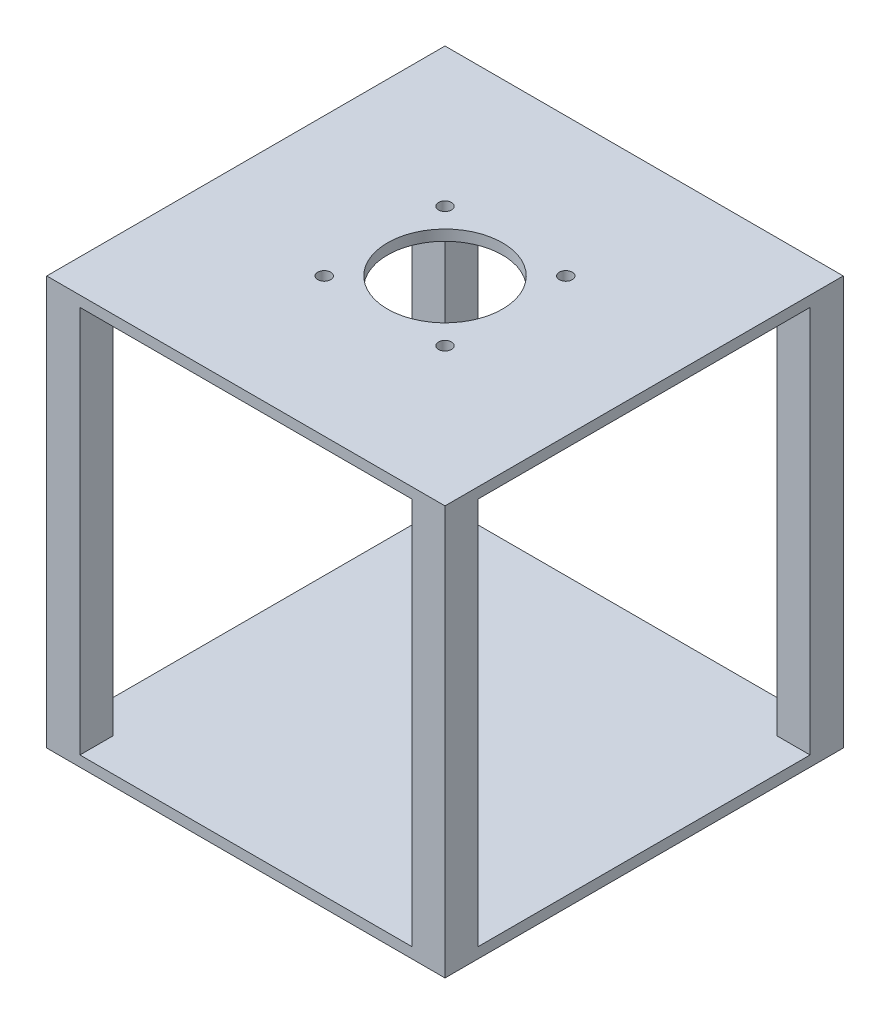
ISO-10303-21;
HEADER;
FILE_DESCRIPTION(('STEP AP214'),'2;1');
FILE_NAME('part.step','',(''),(''),'','','');
FILE_SCHEMA(('AUTOMOTIVE_DESIGN { 1 0 10303 214 1 1 1 1 }'));
ENDSEC;
DATA;
#1=APPLICATION_CONTEXT('core data for automotive mechanical design processes');
#2=APPLICATION_PROTOCOL_DEFINITION('international standard','automotive_design',2000,#1);
#3=PRODUCT_CONTEXT('',#1,'mechanical');
#4=PRODUCT('Part','Part','',(#3));
#5=PRODUCT_RELATED_PRODUCT_CATEGORY('part','',(#4));
#6=PRODUCT_DEFINITION_FORMATION('','',#4);
#7=PRODUCT_DEFINITION_CONTEXT('part definition',#1,'design');
#8=PRODUCT_DEFINITION('design','',#6,#7);
#9=PRODUCT_DEFINITION_SHAPE('','',#8);
#10=(LENGTH_UNIT() NAMED_UNIT(*) SI_UNIT(.MILLI.,.METRE.));
#11=(NAMED_UNIT(*) PLANE_ANGLE_UNIT() SI_UNIT($,.RADIAN.));
#12=(NAMED_UNIT(*) SI_UNIT($,.STERADIAN.) SOLID_ANGLE_UNIT());
#13=UNCERTAINTY_MEASURE_WITH_UNIT(LENGTH_MEASURE(1.E-05),#10,'distance_accuracy_value','');
#14=(GEOMETRIC_REPRESENTATION_CONTEXT(3) GLOBAL_UNCERTAINTY_ASSIGNED_CONTEXT((#13)) GLOBAL_UNIT_ASSIGNED_CONTEXT((#10,
#11,#12)) REPRESENTATION_CONTEXT('',''));
#15=CARTESIAN_POINT('',(0.,0.,0.));
#16=DIRECTION('',(0.,0.,1.));
#17=DIRECTION('',(1.,0.,0.));
#18=AXIS2_PLACEMENT_3D('',#15,#16,#17);
#19=CARTESIAN_POINT('',(0.,-76.2,-6.35));
#20=DIRECTION('',(0.,0.,1.));
#21=DIRECTION('',(1.,0.,0.));
#22=AXIS2_PLACEMENT_3D('',#19,#20,#21);
#23=PLANE('',#22);
#24=DIRECTION('',(-1.,0.,0.));
#25=VECTOR('',#24,1.);
#26=CARTESIAN_POINT('',(6.35,-74.168,-6.35));
#27=LINE('',#26,#25);
#28=CARTESIAN_POINT('',(6.35,-74.168,-6.35));
#29=VERTEX_POINT('',#28);
#30=CARTESIAN_POINT('',(0.,-74.168,-6.35));
#31=VERTEX_POINT('',#30);
#32=EDGE_CURVE('E549',#29,#31,#27,.T.);
#33=ORIENTED_EDGE('',*,*,#32,.T.);
#34=DIRECTION('',(0.,1.,0.));
#35=VECTOR('',#34,1.);
#36=CARTESIAN_POINT('',(0.,-76.2,-6.35));
#37=LINE('',#36,#35);
#38=CARTESIAN_POINT('',(0.,0.,-6.35));
#39=VERTEX_POINT('',#38);
#40=EDGE_CURVE('E246',#31,#39,#37,.T.);
#41=ORIENTED_EDGE('',*,*,#40,.T.);
#42=DIRECTION('',(1.,0.,0.));
#43=VECTOR('',#42,1.);
#44=CARTESIAN_POINT('',(0.,0.,-6.35));
#45=LINE('',#44,#43);
#46=CARTESIAN_POINT('',(6.35,0.,-6.35));
#47=VERTEX_POINT('',#46);
#48=EDGE_CURVE('E225',#39,#47,#45,.T.);
#49=ORIENTED_EDGE('',*,*,#48,.T.);
#50=DIRECTION('',(0.,1.,0.));
#51=VECTOR('',#50,1.);
#52=CARTESIAN_POINT('',(6.35,-76.2,-6.35));
#53=LINE('',#52,#51);
#54=EDGE_CURVE('E243',#29,#47,#53,.T.);
#55=ORIENTED_EDGE('',*,*,#54,.F.);
#56=EDGE_LOOP('',(#33,#41,#49,#55));
#57=FACE_BOUND('',#56,.T.);
#58=ADVANCED_FACE('F37',(#57),#23,.F.);
#59=CARTESIAN_POINT('',(6.35,-76.2,0.));
#60=DIRECTION('',(-1.,0.,0.));
#61=DIRECTION('',(0.,0.,1.));
#62=AXIS2_PLACEMENT_3D('',#59,#60,#61);
#63=PLANE('',#62);
#64=DIRECTION('',(0.,0.,-1.));
#65=VECTOR('',#64,1.);
#66=CARTESIAN_POINT('',(6.35,-74.168,0.));
#67=LINE('',#66,#65);
#68=CARTESIAN_POINT('',(6.35,-74.168,0.));
#69=VERTEX_POINT('',#68);
#70=EDGE_CURVE('E573',#69,#29,#67,.T.);
#71=ORIENTED_EDGE('',*,*,#70,.T.);
#72=ORIENTED_EDGE('',*,*,#54,.T.);
#73=DIRECTION('',(0.,0.,1.));
#74=VECTOR('',#73,1.);
#75=CARTESIAN_POINT('',(6.35,0.,0.));
#76=LINE('',#75,#74);
#77=CARTESIAN_POINT('',(6.35,0.,0.));
#78=VERTEX_POINT('',#77);
#79=EDGE_CURVE('E230',#47,#78,#76,.T.);
#80=ORIENTED_EDGE('',*,*,#79,.T.);
#81=DIRECTION('',(0.,1.,0.));
#82=VECTOR('',#81,1.);
#83=CARTESIAN_POINT('',(6.35,-76.2,0.));
#84=LINE('',#83,#82);
#85=EDGE_CURVE('E234',#69,#78,#84,.T.);
#86=ORIENTED_EDGE('',*,*,#85,.F.);
#87=EDGE_LOOP('',(#71,#72,#80,#86));
#88=FACE_BOUND('',#87,.T.);
#89=ADVANCED_FACE('F324',(#88),#63,.F.);
#90=CARTESIAN_POINT('',(6.35,-76.2,-76.2));
#91=DIRECTION('',(-1.,0.,0.));
#92=DIRECTION('',(0.,0.,1.));
#93=AXIS2_PLACEMENT_3D('',#90,#91,#92);
#94=PLANE('',#93);
#95=DIRECTION('',(0.,0.,-1.));
#96=VECTOR('',#95,1.);
#97=CARTESIAN_POINT('',(6.35,-74.168,-69.85));
#98=LINE('',#97,#96);
#99=CARTESIAN_POINT('',(6.35,-74.168,-69.85));
#100=VERTEX_POINT('',#99);
#101=CARTESIAN_POINT('',(6.35,-74.168,-76.2));
#102=VERTEX_POINT('',#101);
#103=EDGE_CURVE('E529',#100,#102,#98,.T.);
#104=ORIENTED_EDGE('',*,*,#103,.T.);
#105=DIRECTION('',(0.,1.,0.));
#106=VECTOR('',#105,1.);
#107=CARTESIAN_POINT('',(6.35,-76.2,-76.2));
#108=LINE('',#107,#106);
#109=CARTESIAN_POINT('',(6.35,0.,-76.2));
#110=VERTEX_POINT('',#109);
#111=EDGE_CURVE('E222',#102,#110,#108,.T.);
#112=ORIENTED_EDGE('',*,*,#111,.T.);
#113=DIRECTION('',(0.,0.,1.));
#114=VECTOR('',#113,1.);
#115=CARTESIAN_POINT('',(6.35,0.,-76.2));
#116=LINE('',#115,#114);
#117=CARTESIAN_POINT('',(6.35,0.,-69.85));
#118=VERTEX_POINT('',#117);
#119=EDGE_CURVE('E205',#110,#118,#116,.T.);
#120=ORIENTED_EDGE('',*,*,#119,.T.);
#121=DIRECTION('',(0.,1.,0.));
#122=VECTOR('',#121,1.);
#123=CARTESIAN_POINT('',(6.35,-76.2,-69.85));
#124=LINE('',#123,#122);
#125=EDGE_CURVE('E219',#100,#118,#124,.T.);
#126=ORIENTED_EDGE('',*,*,#125,.F.);
#127=EDGE_LOOP('',(#104,#112,#120,#126));
#128=FACE_BOUND('',#127,.T.);
#129=ADVANCED_FACE('F330',(#128),#94,.F.);
#130=CARTESIAN_POINT('',(0.,-76.2,-69.85));
#131=DIRECTION('',(0.,0.,-1.));
#132=DIRECTION('',(-1.,0.,0.));
#133=AXIS2_PLACEMENT_3D('',#130,#131,#132);
#134=PLANE('',#133);
#135=DIRECTION('',(1.,0.,0.));
#136=VECTOR('',#135,1.);
#137=CARTESIAN_POINT('',(0.,-74.168,-69.85));
#138=LINE('',#137,#136);
#139=CARTESIAN_POINT('',(0.,-74.168,-69.85));
#140=VERTEX_POINT('',#139);
#141=EDGE_CURVE('E534',#140,#100,#138,.T.);
#142=ORIENTED_EDGE('',*,*,#141,.T.);
#143=ORIENTED_EDGE('',*,*,#125,.T.);
#144=DIRECTION('',(-1.,0.,0.));
#145=VECTOR('',#144,1.);
#146=CARTESIAN_POINT('',(0.,0.,-69.85));
#147=LINE('',#146,#145);
#148=CARTESIAN_POINT('',(0.,0.,-69.85));
#149=VERTEX_POINT('',#148);
#150=EDGE_CURVE('E210',#118,#149,#147,.T.);
#151=ORIENTED_EDGE('',*,*,#150,.T.);
#152=DIRECTION('',(0.,1.,0.));
#153=VECTOR('',#152,1.);
#154=CARTESIAN_POINT('',(0.,-76.2,-69.85));
#155=LINE('',#154,#153);
#156=EDGE_CURVE('E209',#140,#149,#155,.T.);
#157=ORIENTED_EDGE('',*,*,#156,.F.);
#158=EDGE_LOOP('',(#142,#143,#151,#157));
#159=FACE_BOUND('',#158,.T.);
#160=ADVANCED_FACE('F487',(#159),#134,.F.);
#161=CARTESIAN_POINT('',(76.2,-76.2,-69.8499999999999));
#162=DIRECTION('',(0.,0.,-1.));
#163=DIRECTION('',(-1.,0.,0.));
#164=AXIS2_PLACEMENT_3D('',#161,#162,#163);
#165=PLANE('',#164);
#166=DIRECTION('',(1.,0.,0.));
#167=VECTOR('',#166,1.);
#168=CARTESIAN_POINT('',(69.85,-74.168,-69.8499999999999));
#169=LINE('',#168,#167);
#170=CARTESIAN_POINT('',(69.85,-74.168,-69.8499999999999));
#171=VERTEX_POINT('',#170);
#172=CARTESIAN_POINT('',(76.2,-74.168,-69.8499999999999));
#173=VERTEX_POINT('',#172);
#174=EDGE_CURVE('E559',#171,#173,#169,.T.);
#175=ORIENTED_EDGE('',*,*,#174,.T.);
#176=DIRECTION('',(0.,1.,0.));
#177=VECTOR('',#176,1.);
#178=CARTESIAN_POINT('',(76.2,-76.2,-69.8499999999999));
#179=LINE('',#178,#177);
#180=CARTESIAN_POINT('',(76.2,0.,-69.8499999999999));
#181=VERTEX_POINT('',#180);
#182=EDGE_CURVE('E166',#173,#181,#179,.T.);
#183=ORIENTED_EDGE('',*,*,#182,.T.);
#184=DIRECTION('',(-1.,0.,0.));
#185=VECTOR('',#184,1.);
#186=CARTESIAN_POINT('',(76.2,0.,-69.8499999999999));
#187=LINE('',#186,#185);
#188=CARTESIAN_POINT('',(69.85,0.,-69.8499999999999));
#189=VERTEX_POINT('',#188);
#190=EDGE_CURVE('E187',#181,#189,#187,.T.);
#191=ORIENTED_EDGE('',*,*,#190,.T.);
#192=DIRECTION('',(0.,1.,0.));
#193=VECTOR('',#192,1.);
#194=CARTESIAN_POINT('',(69.85,-76.2,-69.8499999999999));
#195=LINE('',#194,#193);
#196=EDGE_CURVE('E200',#171,#189,#195,.T.);
#197=ORIENTED_EDGE('',*,*,#196,.F.);
#198=EDGE_LOOP('',(#175,#183,#191,#197));
#199=FACE_BOUND('',#198,.T.);
#200=ADVANCED_FACE('F477',(#199),#165,.F.);
#201=CARTESIAN_POINT('',(69.85,-76.2,-76.1999999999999));
#202=DIRECTION('',(1.,0.,0.));
#203=DIRECTION('',(0.,0.,-1.));
#204=AXIS2_PLACEMENT_3D('',#201,#202,#203);
#205=PLANE('',#204);
#206=DIRECTION('',(0.,0.,1.));
#207=VECTOR('',#206,1.);
#208=CARTESIAN_POINT('',(69.85,-74.168,-76.2));
#209=LINE('',#208,#207);
#210=CARTESIAN_POINT('',(69.85,-74.168,-76.2));
#211=VERTEX_POINT('',#210);
#212=EDGE_CURVE('E555',#211,#171,#209,.T.);
#213=ORIENTED_EDGE('',*,*,#212,.T.);
#214=ORIENTED_EDGE('',*,*,#196,.T.);
#215=DIRECTION('',(0.,0.,-1.));
#216=VECTOR('',#215,1.);
#217=CARTESIAN_POINT('',(69.85,0.,-76.1999999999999));
#218=LINE('',#217,#216);
#219=CARTESIAN_POINT('',(69.85,0.,-76.2));
#220=VERTEX_POINT('',#219);
#221=EDGE_CURVE('E192',#189,#220,#218,.T.);
#222=ORIENTED_EDGE('',*,*,#221,.T.);
#223=DIRECTION('',(0.,1.,0.));
#224=VECTOR('',#223,1.);
#225=CARTESIAN_POINT('',(69.85,-76.2,-76.1999999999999));
#226=LINE('',#225,#224);
#227=EDGE_CURVE('E61',#211,#220,#226,.T.);
#228=ORIENTED_EDGE('',*,*,#227,.F.);
#229=EDGE_LOOP('',(#213,#214,#222,#228));
#230=FACE_BOUND('',#229,.T.);
#231=ADVANCED_FACE('F467',(#230),#205,.F.);
#232=CARTESIAN_POINT('',(69.85,-76.2,0.));
#233=DIRECTION('',(1.,0.,0.));
#234=DIRECTION('',(0.,0.,-1.));
#235=AXIS2_PLACEMENT_3D('',#232,#233,#234);
#236=PLANE('',#235);
#237=DIRECTION('',(0.,0.,1.));
#238=VECTOR('',#237,1.);
#239=CARTESIAN_POINT('',(69.85,-74.168,-6.34999999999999));
#240=LINE('',#239,#238);
#241=CARTESIAN_POINT('',(69.85,-74.168,-6.34999999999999));
#242=VERTEX_POINT('',#241);
#243=CARTESIAN_POINT('',(69.85,-74.168,0.));
#244=VERTEX_POINT('',#243);
#245=EDGE_CURVE('E158',#242,#244,#240,.T.);
#246=ORIENTED_EDGE('',*,*,#245,.T.);
#247=DIRECTION('',(0.,1.,0.));
#248=VECTOR('',#247,1.);
#249=CARTESIAN_POINT('',(69.85,-76.2,0.));
#250=LINE('',#249,#248);
#251=CARTESIAN_POINT('',(69.85,0.,0.));
#252=VERTEX_POINT('',#251);
#253=EDGE_CURVE('E179',#244,#252,#250,.T.);
#254=ORIENTED_EDGE('',*,*,#253,.T.);
#255=DIRECTION('',(0.,0.,-1.));
#256=VECTOR('',#255,1.);
#257=CARTESIAN_POINT('',(69.85,0.,0.));
#258=LINE('',#257,#256);
#259=CARTESIAN_POINT('',(69.85,0.,-6.34999999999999));
#260=VERTEX_POINT('',#259);
#261=EDGE_CURVE('E181',#252,#260,#258,.T.);
#262=ORIENTED_EDGE('',*,*,#261,.T.);
#263=DIRECTION('',(0.,1.,0.));
#264=VECTOR('',#263,1.);
#265=CARTESIAN_POINT('',(69.85,-76.2,-6.34999999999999));
#266=LINE('',#265,#264);
#267=EDGE_CURVE('E175',#242,#260,#266,.T.);
#268=ORIENTED_EDGE('',*,*,#267,.F.);
#269=EDGE_LOOP('',(#246,#254,#262,#268));
#270=FACE_BOUND('',#269,.T.);
#271=ADVANCED_FACE('F458',(#270),#236,.F.);
#272=CARTESIAN_POINT('',(76.2,-76.2,-6.34999999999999));
#273=DIRECTION('',(0.,0.,1.));
#274=DIRECTION('',(1.,0.,0.));
#275=AXIS2_PLACEMENT_3D('',#272,#273,#274);
#276=PLANE('',#275);
#277=DIRECTION('',(-1.,0.,0.));
#278=VECTOR('',#277,1.);
#279=CARTESIAN_POINT('',(76.2,-74.168,-6.34999999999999));
#280=LINE('',#279,#278);
#281=CARTESIAN_POINT('',(76.2,-74.168,-6.34999999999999));
#282=VERTEX_POINT('',#281);
#283=EDGE_CURVE('E153',#282,#242,#280,.T.);
#284=ORIENTED_EDGE('',*,*,#283,.T.);
#285=ORIENTED_EDGE('',*,*,#267,.T.);
#286=DIRECTION('',(1.,0.,0.));
#287=VECTOR('',#286,1.);
#288=CARTESIAN_POINT('',(76.2,0.,-6.34999999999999));
#289=LINE('',#288,#287);
#290=CARTESIAN_POINT('',(76.2,0.,-6.34999999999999));
#291=VERTEX_POINT('',#290);
#292=EDGE_CURVE('E172',#260,#291,#289,.T.);
#293=ORIENTED_EDGE('',*,*,#292,.T.);
#294=DIRECTION('',(0.,1.,0.));
#295=VECTOR('',#294,1.);
#296=CARTESIAN_POINT('',(76.2,-76.2,-6.34999999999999));
#297=LINE('',#296,#295);
#298=EDGE_CURVE('E53',#282,#291,#297,.T.);
#299=ORIENTED_EDGE('',*,*,#298,.F.);
#300=EDGE_LOOP('',(#284,#285,#293,#299));
#301=FACE_BOUND('',#300,.T.);
#302=ADVANCED_FACE('F170',(#301),#276,.F.);
#303=CARTESIAN_POINT('',(0.,0.,0.));
#304=DIRECTION('',(0.,-1.,0.));
#305=DIRECTION('',(0.,0.,-1.));
#306=AXIS2_PLACEMENT_3D('',#303,#304,#305);
#307=PLANE('',#306);
#308=CARTESIAN_POINT('',(49.657,0.,-26.543));
#309=DIRECTION('',(0.,-1.,0.));
#310=DIRECTION('',(0.,0.,-1.));
#311=AXIS2_PLACEMENT_3D('',#308,#309,#310);
#312=CIRCLE('',#311,1.24968);
#313=CARTESIAN_POINT('',(49.657,0.,-27.79268));
#314=VERTEX_POINT('',#313);
#315=EDGE_CURVE('E596',#314,#314,#312,.F.);
#316=ORIENTED_EDGE('',*,*,#315,.T.);
#317=EDGE_LOOP('',(#316));
#318=FACE_BOUND('',#317,.T.);
#319=CARTESIAN_POINT('',(49.657,0.,-49.657));
#320=DIRECTION('',(0.,-1.,0.));
#321=DIRECTION('',(0.,0.,-1.));
#322=AXIS2_PLACEMENT_3D('',#319,#320,#321);
#323=CIRCLE('',#322,1.24968);
#324=CARTESIAN_POINT('',(49.657,0.,-50.90668));
#325=VERTEX_POINT('',#324);
#326=EDGE_CURVE('E595',#325,#325,#323,.F.);
#327=ORIENTED_EDGE('',*,*,#326,.T.);
#328=EDGE_LOOP('',(#327));
#329=FACE_BOUND('',#328,.T.);
#330=CARTESIAN_POINT('',(26.543,0.,-49.657));
#331=DIRECTION('',(0.,-1.,0.));
#332=DIRECTION('',(0.,0.,-1.));
#333=AXIS2_PLACEMENT_3D('',#330,#331,#332);
#334=CIRCLE('',#333,1.24968);
#335=CARTESIAN_POINT('',(26.543,0.,-50.90668));
#336=VERTEX_POINT('',#335);
#337=EDGE_CURVE('E604',#336,#336,#334,.F.);
#338=ORIENTED_EDGE('',*,*,#337,.T.);
#339=EDGE_LOOP('',(#338));
#340=FACE_BOUND('',#339,.T.);
#341=CARTESIAN_POINT('',(26.543,0.,-26.543));
#342=DIRECTION('',(0.,-1.,0.));
#343=DIRECTION('',(0.,0.,-1.));
#344=AXIS2_PLACEMENT_3D('',#341,#342,#343);
#345=CIRCLE('',#344,1.24968);
#346=CARTESIAN_POINT('',(26.543,0.,-27.79268));
#347=VERTEX_POINT('',#346);
#348=EDGE_CURVE('E586',#347,#347,#345,.F.);
#349=ORIENTED_EDGE('',*,*,#348,.T.);
#350=EDGE_LOOP('',(#349));
#351=FACE_BOUND('',#350,.T.);
#352=CARTESIAN_POINT('',(38.1,0.,-38.1));
#353=DIRECTION('',(0.,1.,0.));
#354=DIRECTION('',(0.,0.,1.));
#355=AXIS2_PLACEMENT_3D('',#352,#353,#354);
#356=CIRCLE('',#355,10.9982);
#357=CARTESIAN_POINT('',(38.1,0.,-27.1018));
#358=VERTEX_POINT('',#357);
#359=EDGE_CURVE('E250',#358,#358,#356,.T.);
#360=ORIENTED_EDGE('',*,*,#359,.T.);
#361=EDGE_LOOP('',(#360));
#362=FACE_BOUND('',#361,.T.);
#363=ORIENTED_EDGE('',*,*,#292,.F.);
#364=ORIENTED_EDGE('',*,*,#261,.F.);
#365=DIRECTION('',(1.,0.,0.));
#366=VECTOR('',#365,1.);
#367=CARTESIAN_POINT('',(0.,0.,0.));
#368=LINE('',#367,#366);
#369=EDGE_CURVE('E276',#78,#252,#368,.T.);
#370=ORIENTED_EDGE('',*,*,#369,.F.);
#371=ORIENTED_EDGE('',*,*,#79,.F.);
#372=ORIENTED_EDGE('',*,*,#48,.F.);
#373=DIRECTION('',(0.,0.,1.));
#374=VECTOR('',#373,1.);
#375=CARTESIAN_POINT('',(0.,0.,0.));
#376=LINE('',#375,#374);
#377=EDGE_CURVE('E254',#149,#39,#376,.T.);
#378=ORIENTED_EDGE('',*,*,#377,.F.);
#379=ORIENTED_EDGE('',*,*,#150,.F.);
#380=ORIENTED_EDGE('',*,*,#119,.F.);
#381=DIRECTION('',(-1.,0.,0.));
#382=VECTOR('',#381,1.);
#383=CARTESIAN_POINT('',(0.,0.,-76.2));
#384=LINE('',#383,#382);
#385=EDGE_CURVE('E263',#220,#110,#384,.T.);
#386=ORIENTED_EDGE('',*,*,#385,.F.);
#387=ORIENTED_EDGE('',*,*,#221,.F.);
#388=ORIENTED_EDGE('',*,*,#190,.F.);
#389=DIRECTION('',(0.,0.,-1.));
#390=VECTOR('',#389,1.);
#391=CARTESIAN_POINT('',(76.2,0.,0.));
#392=LINE('',#391,#390);
#393=EDGE_CURVE('E280',#291,#181,#392,.T.);
#394=ORIENTED_EDGE('',*,*,#393,.F.);
#395=EDGE_LOOP('',(#363,#364,#370,#371,#372,#378,#379,#380,#386,#387,#388,#394));
#396=FACE_BOUND('',#395,.T.);
#397=ADVANCED_FACE('F313',(#318,#329,#340,#351,#362,#396),#307,.T.);
#398=CARTESIAN_POINT('',(0.,2.032,0.));
#399=DIRECTION('',(1.,0.,0.));
#400=DIRECTION('',(0.,0.,-1.));
#401=AXIS2_PLACEMENT_3D('',#398,#399,#400);
#402=PLANE('',#401);
#403=ORIENTED_EDGE('',*,*,#40,.F.);
#404=DIRECTION('',(0.,0.,-1.));
#405=VECTOR('',#404,1.);
#406=CARTESIAN_POINT('',(0.,-74.168,-6.35));
#407=LINE('',#406,#405);
#408=EDGE_CURVE('E546',#31,#140,#407,.T.);
#409=ORIENTED_EDGE('',*,*,#408,.T.);
#410=ORIENTED_EDGE('',*,*,#156,.T.);
#411=ORIENTED_EDGE('',*,*,#377,.T.);
#412=EDGE_LOOP('',(#403,#409,#410,#411));
#413=FACE_BOUND('',#412,.T.);
#414=DIRECTION('',(0.,-1.,0.));
#415=VECTOR('',#414,1.);
#416=CARTESIAN_POINT('',(0.,2.032,-76.2));
#417=LINE('',#416,#415);
#418=CARTESIAN_POINT('',(0.,2.032,-76.2));
#419=VERTEX_POINT('',#418);
#420=CARTESIAN_POINT('',(0.,-76.2,-76.2));
#421=VERTEX_POINT('',#420);
#422=EDGE_CURVE('E272',#419,#421,#417,.T.);
#423=ORIENTED_EDGE('',*,*,#422,.T.);
#424=DIRECTION('',(0.,0.,-1.));
#425=VECTOR('',#424,1.);
#426=CARTESIAN_POINT('',(0.,-76.2,0.));
#427=LINE('',#426,#425);
#428=CARTESIAN_POINT('',(0.,-76.2,0.));
#429=VERTEX_POINT('',#428);
#430=EDGE_CURVE('E226',#429,#421,#427,.T.);
#431=ORIENTED_EDGE('',*,*,#430,.F.);
#432=DIRECTION('',(0.,-1.,0.));
#433=VECTOR('',#432,1.);
#434=CARTESIAN_POINT('',(0.,2.032,0.));
#435=LINE('',#434,#433);
#436=CARTESIAN_POINT('',(0.,2.032,0.));
#437=VERTEX_POINT('',#436);
#438=EDGE_CURVE('E11',#437,#429,#435,.T.);
#439=ORIENTED_EDGE('',*,*,#438,.F.);
#440=DIRECTION('',(0.,0.,1.));
#441=VECTOR('',#440,1.);
#442=CARTESIAN_POINT('',(0.,2.032,0.));
#443=LINE('',#442,#441);
#444=EDGE_CURVE('E258',#419,#437,#443,.T.);
#445=ORIENTED_EDGE('',*,*,#444,.F.);
#446=EDGE_LOOP('',(#423,#431,#439,#445));
#447=FACE_BOUND('',#446,.T.);
#448=ADVANCED_FACE('F39',(#413,#447),#402,.F.);
#449=CARTESIAN_POINT('',(0.,2.032,0.));
#450=DIRECTION('',(0.,0.,-1.));
#451=DIRECTION('',(-1.,0.,0.));
#452=AXIS2_PLACEMENT_3D('',#449,#450,#451);
#453=PLANE('',#452);
#454=DIRECTION('',(-1.,0.,0.));
#455=VECTOR('',#454,1.);
#456=CARTESIAN_POINT('',(69.85,-74.168,0.));
#457=LINE('',#456,#455);
#458=EDGE_CURVE('E571',#244,#69,#457,.T.);
#459=ORIENTED_EDGE('',*,*,#458,.T.);
#460=ORIENTED_EDGE('',*,*,#85,.T.);
#461=ORIENTED_EDGE('',*,*,#369,.T.);
#462=ORIENTED_EDGE('',*,*,#253,.F.);
#463=EDGE_LOOP('',(#459,#460,#461,#462));
#464=FACE_BOUND('',#463,.T.);
#465=ORIENTED_EDGE('',*,*,#438,.T.);
#466=DIRECTION('',(-1.,0.,0.));
#467=VECTOR('',#466,1.);
#468=CARTESIAN_POINT('',(0.,-76.2,0.));
#469=LINE('',#468,#467);
#470=CARTESIAN_POINT('',(76.2,-76.2,0.));
#471=VERTEX_POINT('',#470);
#472=EDGE_CURVE('E229',#471,#429,#469,.T.);
#473=ORIENTED_EDGE('',*,*,#472,.F.);
#474=DIRECTION('',(0.,-1.,0.));
#475=VECTOR('',#474,1.);
#476=CARTESIAN_POINT('',(76.2,2.032,0.));
#477=LINE('',#476,#475);
#478=CARTESIAN_POINT('',(76.2,2.032,0.));
#479=VERTEX_POINT('',#478);
#480=EDGE_CURVE('E46',#479,#471,#477,.T.);
#481=ORIENTED_EDGE('',*,*,#480,.F.);
#482=DIRECTION('',(1.,0.,0.));
#483=VECTOR('',#482,1.);
#484=CARTESIAN_POINT('',(0.,2.032,0.));
#485=LINE('',#484,#483);
#486=EDGE_CURVE('E262',#437,#479,#485,.T.);
#487=ORIENTED_EDGE('',*,*,#486,.F.);
#488=EDGE_LOOP('',(#465,#473,#481,#487));
#489=FACE_BOUND('',#488,.T.);
#490=ADVANCED_FACE('F298',(#464,#489),#453,.F.);
#491=CARTESIAN_POINT('',(76.2,2.032,0.));
#492=DIRECTION('',(-1.,0.,0.));
#493=DIRECTION('',(0.,0.,1.));
#494=AXIS2_PLACEMENT_3D('',#491,#492,#493);
#495=PLANE('',#494);
#496=ORIENTED_EDGE('',*,*,#182,.F.);
#497=DIRECTION('',(0.,0.,1.));
#498=VECTOR('',#497,1.);
#499=CARTESIAN_POINT('',(76.2,-74.168,-69.8499999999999));
#500=LINE('',#499,#498);
#501=EDGE_CURVE('E155',#173,#282,#500,.T.);
#502=ORIENTED_EDGE('',*,*,#501,.T.);
#503=ORIENTED_EDGE('',*,*,#298,.T.);
#504=ORIENTED_EDGE('',*,*,#393,.T.);
#505=EDGE_LOOP('',(#496,#502,#503,#504));
#506=FACE_BOUND('',#505,.T.);
#507=ORIENTED_EDGE('',*,*,#480,.T.);
#508=DIRECTION('',(0.,0.,1.));
#509=VECTOR('',#508,1.);
#510=CARTESIAN_POINT('',(76.2,-76.2,-76.1999999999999));
#511=LINE('',#510,#509);
#512=CARTESIAN_POINT('',(76.2,-76.2,-76.1999999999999));
#513=VERTEX_POINT('',#512);
#514=EDGE_CURVE('E188',#513,#471,#511,.T.);
#515=ORIENTED_EDGE('',*,*,#514,.F.);
#516=DIRECTION('',(0.,-1.,0.));
#517=VECTOR('',#516,1.);
#518=CARTESIAN_POINT('',(76.2,2.032,-76.2));
#519=LINE('',#518,#517);
#520=CARTESIAN_POINT('',(76.2,2.032,-76.2));
#521=VERTEX_POINT('',#520);
#522=EDGE_CURVE('E288',#521,#513,#519,.T.);
#523=ORIENTED_EDGE('',*,*,#522,.F.);
#524=DIRECTION('',(0.,0.,-1.));
#525=VECTOR('',#524,1.);
#526=CARTESIAN_POINT('',(76.2,2.032,0.));
#527=LINE('',#526,#525);
#528=EDGE_CURVE('E266',#479,#521,#527,.T.);
#529=ORIENTED_EDGE('',*,*,#528,.F.);
#530=EDGE_LOOP('',(#507,#515,#523,#529));
#531=FACE_BOUND('',#530,.T.);
#532=ADVANCED_FACE('F164',(#506,#531),#495,.F.);
#533=CARTESIAN_POINT('',(0.,2.032,-76.2));
#534=DIRECTION('',(0.,0.,1.));
#535=DIRECTION('',(1.,0.,0.));
#536=AXIS2_PLACEMENT_3D('',#533,#534,#535);
#537=PLANE('',#536);
#538=ORIENTED_EDGE('',*,*,#111,.F.);
#539=DIRECTION('',(1.,0.,0.));
#540=VECTOR('',#539,1.);
#541=CARTESIAN_POINT('',(6.35,-74.168,-76.2));
#542=LINE('',#541,#540);
#543=EDGE_CURVE('E533',#102,#211,#542,.T.);
#544=ORIENTED_EDGE('',*,*,#543,.T.);
#545=ORIENTED_EDGE('',*,*,#227,.T.);
#546=ORIENTED_EDGE('',*,*,#385,.T.);
#547=EDGE_LOOP('',(#538,#544,#545,#546));
#548=FACE_BOUND('',#547,.T.);
#549=ORIENTED_EDGE('',*,*,#522,.T.);
#550=DIRECTION('',(1.,0.,0.));
#551=VECTOR('',#550,1.);
#552=CARTESIAN_POINT('',(0.,-76.2,-76.2));
#553=LINE('',#552,#551);
#554=EDGE_CURVE('E206',#421,#513,#553,.T.);
#555=ORIENTED_EDGE('',*,*,#554,.F.);
#556=ORIENTED_EDGE('',*,*,#422,.F.);
#557=DIRECTION('',(-1.,0.,0.));
#558=VECTOR('',#557,1.);
#559=CARTESIAN_POINT('',(0.,2.032,-76.2));
#560=LINE('',#559,#558);
#561=EDGE_CURVE('E269',#521,#419,#560,.T.);
#562=ORIENTED_EDGE('',*,*,#561,.F.);
#563=EDGE_LOOP('',(#549,#555,#556,#562));
#564=FACE_BOUND('',#563,.T.);
#565=ADVANCED_FACE('F307',(#548,#564),#537,.F.);
#566=CARTESIAN_POINT('',(0.,2.032,0.));
#567=DIRECTION('',(0.,-1.,0.));
#568=DIRECTION('',(0.,0.,-1.));
#569=AXIS2_PLACEMENT_3D('',#566,#567,#568);
#570=PLANE('',#569);
#571=CARTESIAN_POINT('',(49.657,2.032,-26.543));
#572=DIRECTION('',(0.,1.,0.));
#573=DIRECTION('',(0.,0.,1.));
#574=AXIS2_PLACEMENT_3D('',#571,#572,#573);
#575=CIRCLE('',#574,1.24968);
#576=CARTESIAN_POINT('',(49.657,2.032,-25.29332));
#577=VERTEX_POINT('',#576);
#578=EDGE_CURVE('E591',#577,#577,#575,.T.);
#579=ORIENTED_EDGE('',*,*,#578,.F.);
#580=EDGE_LOOP('',(#579));
#581=FACE_BOUND('',#580,.T.);
#582=CARTESIAN_POINT('',(49.657,2.032,-49.657));
#583=DIRECTION('',(0.,1.,0.));
#584=DIRECTION('',(0.,0.,1.));
#585=AXIS2_PLACEMENT_3D('',#582,#583,#584);
#586=CIRCLE('',#585,1.24968);
#587=CARTESIAN_POINT('',(49.657,2.032,-48.40732));
#588=VERTEX_POINT('',#587);
#589=EDGE_CURVE('E600',#588,#588,#586,.T.);
#590=ORIENTED_EDGE('',*,*,#589,.F.);
#591=EDGE_LOOP('',(#590));
#592=FACE_BOUND('',#591,.T.);
#593=CARTESIAN_POINT('',(26.543,2.032,-49.657));
#594=DIRECTION('',(0.,1.,0.));
#595=DIRECTION('',(0.,0.,1.));
#596=AXIS2_PLACEMENT_3D('',#593,#594,#595);
#597=CIRCLE('',#596,1.24968);
#598=CARTESIAN_POINT('',(26.543,2.032,-48.40732));
#599=VERTEX_POINT('',#598);
#600=EDGE_CURVE('E590',#599,#599,#597,.T.);
#601=ORIENTED_EDGE('',*,*,#600,.F.);
#602=EDGE_LOOP('',(#601));
#603=FACE_BOUND('',#602,.T.);
#604=CARTESIAN_POINT('',(26.543,2.032,-26.543));
#605=DIRECTION('',(0.,1.,0.));
#606=DIRECTION('',(0.,0.,1.));
#607=AXIS2_PLACEMENT_3D('',#604,#605,#606);
#608=CIRCLE('',#607,1.24968);
#609=CARTESIAN_POINT('',(26.543,2.032,-25.29332));
#610=VERTEX_POINT('',#609);
#611=EDGE_CURVE('E168',#610,#610,#608,.T.);
#612=ORIENTED_EDGE('',*,*,#611,.F.);
#613=EDGE_LOOP('',(#612));
#614=FACE_BOUND('',#613,.T.);
#615=CARTESIAN_POINT('',(38.1,2.032,-38.1));
#616=DIRECTION('',(0.,1.,0.));
#617=DIRECTION('',(0.,0.,1.));
#618=AXIS2_PLACEMENT_3D('',#615,#616,#617);
#619=CIRCLE('',#618,10.9982);
#620=CARTESIAN_POINT('',(38.1,2.032,-27.1018));
#621=VERTEX_POINT('',#620);
#622=EDGE_CURVE('E249',#621,#621,#619,.T.);
#623=ORIENTED_EDGE('',*,*,#622,.F.);
#624=EDGE_LOOP('',(#623));
#625=FACE_BOUND('',#624,.T.);
#626=ORIENTED_EDGE('',*,*,#444,.T.);
#627=ORIENTED_EDGE('',*,*,#486,.T.);
#628=ORIENTED_EDGE('',*,*,#528,.T.);
#629=ORIENTED_EDGE('',*,*,#561,.T.);
#630=EDGE_LOOP('',(#626,#627,#628,#629));
#631=FACE_BOUND('',#630,.T.);
#632=ADVANCED_FACE('F310',(#581,#592,#603,#614,#625,#631),#570,.F.);
#633=CARTESIAN_POINT('',(38.1,0.,-38.1));
#634=DIRECTION('',(0.,1.,0.));
#635=DIRECTION('',(0.,0.,1.));
#636=AXIS2_PLACEMENT_3D('',#633,#634,#635);
#637=CYLINDRICAL_SURFACE('',#636,10.9982);
#638=ORIENTED_EDGE('',*,*,#359,.F.);
#639=EDGE_LOOP('',(#638));
#640=FACE_BOUND('',#639,.T.);
#641=ORIENTED_EDGE('',*,*,#622,.T.);
#642=EDGE_LOOP('',(#641));
#643=FACE_BOUND('',#642,.T.);
#644=ADVANCED_FACE('F336',(#640,#643),#637,.F.);
#645=CARTESIAN_POINT('',(0.,-76.2,0.));
#646=DIRECTION('',(0.,-1.,0.));
#647=DIRECTION('',(0.,0.,-1.));
#648=AXIS2_PLACEMENT_3D('',#645,#646,#647);
#649=PLANE('',#648);
#650=ORIENTED_EDGE('',*,*,#430,.T.);
#651=ORIENTED_EDGE('',*,*,#554,.T.);
#652=ORIENTED_EDGE('',*,*,#514,.T.);
#653=ORIENTED_EDGE('',*,*,#472,.T.);
#654=EDGE_LOOP('',(#650,#651,#652,#653));
#655=FACE_BOUND('',#654,.T.);
#656=ADVANCED_FACE('F302',(#655),#649,.T.);
#657=CARTESIAN_POINT('',(0.,-74.168,0.));
#658=DIRECTION('',(0.,-1.,0.));
#659=DIRECTION('',(0.,0.,-1.));
#660=AXIS2_PLACEMENT_3D('',#657,#658,#659);
#661=PLANE('',#660);
#662=ORIENTED_EDGE('',*,*,#501,.F.);
#663=ORIENTED_EDGE('',*,*,#174,.F.);
#664=ORIENTED_EDGE('',*,*,#212,.F.);
#665=ORIENTED_EDGE('',*,*,#543,.F.);
#666=ORIENTED_EDGE('',*,*,#103,.F.);
#667=ORIENTED_EDGE('',*,*,#141,.F.);
#668=ORIENTED_EDGE('',*,*,#408,.F.);
#669=ORIENTED_EDGE('',*,*,#32,.F.);
#670=ORIENTED_EDGE('',*,*,#70,.F.);
#671=ORIENTED_EDGE('',*,*,#458,.F.);
#672=ORIENTED_EDGE('',*,*,#245,.F.);
#673=ORIENTED_EDGE('',*,*,#283,.F.);
#674=EDGE_LOOP('',(#662,#663,#664,#665,#666,#667,#668,#669,#670,#671,#672,#673));
#675=FACE_BOUND('',#674,.T.);
#676=ADVANCED_FACE('F154',(#675),#661,.F.);
#677=CARTESIAN_POINT('',(26.543,-76.201,-26.543));
#678=DIRECTION('',(0.,1.,0.));
#679=DIRECTION('',(0.,0.,1.));
#680=AXIS2_PLACEMENT_3D('',#677,#678,#679);
#681=CYLINDRICAL_SURFACE('',#680,1.24968);
#682=ORIENTED_EDGE('',*,*,#348,.F.);
#683=EDGE_LOOP('',(#682));
#684=FACE_BOUND('',#683,.T.);
#685=ORIENTED_EDGE('',*,*,#611,.T.);
#686=EDGE_LOOP('',(#685));
#687=FACE_BOUND('',#686,.T.);
#688=ADVANCED_FACE('F375',(#684,#687),#681,.F.);
#689=CARTESIAN_POINT('',(26.543,-76.201,-49.657));
#690=DIRECTION('',(0.,1.,0.));
#691=DIRECTION('',(0.,0.,1.));
#692=AXIS2_PLACEMENT_3D('',#689,#690,#691);
#693=CYLINDRICAL_SURFACE('',#692,1.24968);
#694=ORIENTED_EDGE('',*,*,#337,.F.);
#695=EDGE_LOOP('',(#694));
#696=FACE_BOUND('',#695,.T.);
#697=ORIENTED_EDGE('',*,*,#600,.T.);
#698=EDGE_LOOP('',(#697));
#699=FACE_BOUND('',#698,.T.);
#700=ADVANCED_FACE('F381',(#696,#699),#693,.F.);
#701=CARTESIAN_POINT('',(49.657,-76.201,-49.657));
#702=DIRECTION('',(0.,1.,0.));
#703=DIRECTION('',(0.,0.,1.));
#704=AXIS2_PLACEMENT_3D('',#701,#702,#703);
#705=CYLINDRICAL_SURFACE('',#704,1.24968);
#706=ORIENTED_EDGE('',*,*,#326,.F.);
#707=EDGE_LOOP('',(#706));
#708=FACE_BOUND('',#707,.T.);
#709=ORIENTED_EDGE('',*,*,#589,.T.);
#710=EDGE_LOOP('',(#709));
#711=FACE_BOUND('',#710,.T.);
#712=ADVANCED_FACE('F389',(#708,#711),#705,.F.);
#713=CARTESIAN_POINT('',(49.657,-76.201,-26.543));
#714=DIRECTION('',(0.,1.,0.));
#715=DIRECTION('',(0.,0.,1.));
#716=AXIS2_PLACEMENT_3D('',#713,#714,#715);
#717=CYLINDRICAL_SURFACE('',#716,1.24968);
#718=ORIENTED_EDGE('',*,*,#315,.F.);
#719=EDGE_LOOP('',(#718));
#720=FACE_BOUND('',#719,.T.);
#721=ORIENTED_EDGE('',*,*,#578,.T.);
#722=EDGE_LOOP('',(#721));
#723=FACE_BOUND('',#722,.T.);
#724=ADVANCED_FACE('F397',(#720,#723),#717,.F.);
#725=CLOSED_SHELL('',(#58,#89,#129,#160,#200,#231,#271,#302,#397,#448,#490,#532,#565,#632,#644,
#656,#676,#688,#700,#712,#724));
#726=MANIFOLD_SOLID_BREP('B2',#725);
#727=ADVANCED_BREP_SHAPE_REPRESENTATION('',(#18,#726),#14);
#728=SHAPE_DEFINITION_REPRESENTATION(#9,#727);
ENDSEC;
END-ISO-10303-21;
